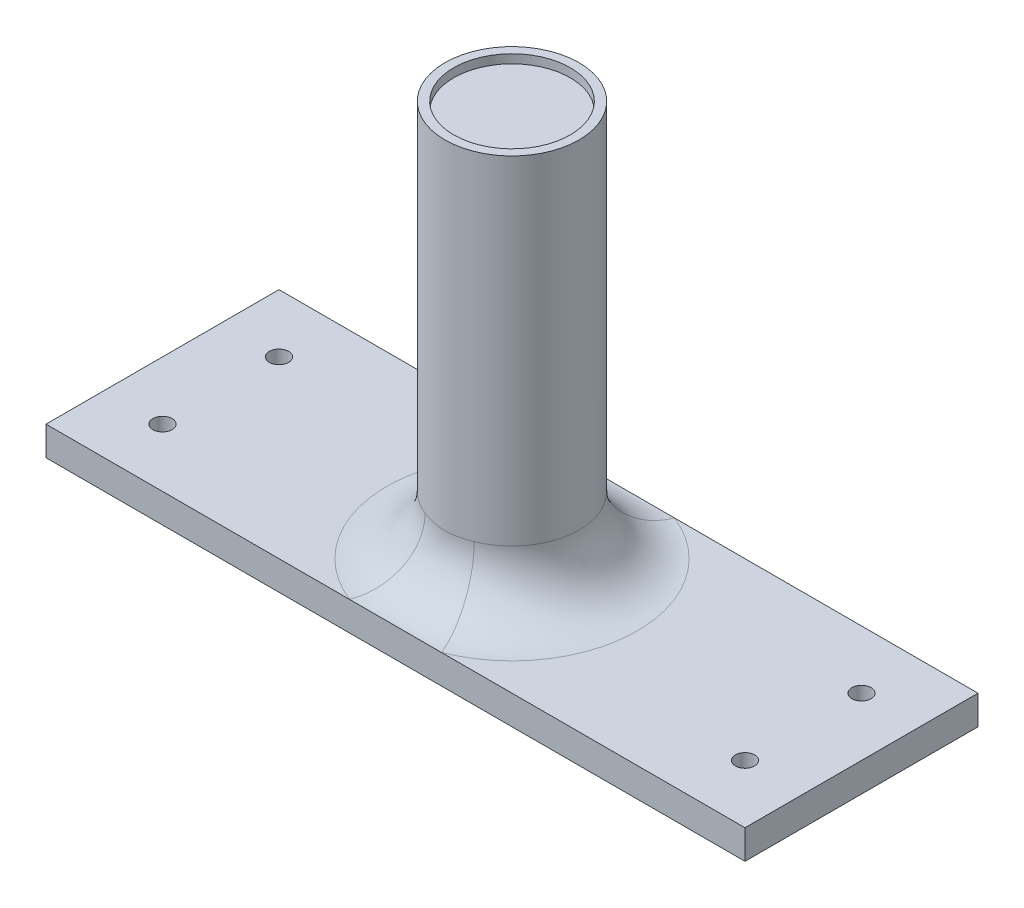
ISO-10303-21;
HEADER;
FILE_DESCRIPTION(('STEP AP214'),'2;1');
FILE_NAME('part.step','',(''),(''),'','','');
FILE_SCHEMA(('AUTOMOTIVE_DESIGN { 1 0 10303 214 1 1 1 1 }'));
ENDSEC;
DATA;
#1=APPLICATION_CONTEXT('core data for automotive mechanical design processes');
#2=APPLICATION_PROTOCOL_DEFINITION('international standard','automotive_design',2000,#1);
#3=PRODUCT_CONTEXT('',#1,'mechanical');
#4=PRODUCT('Part','Part','',(#3));
#5=PRODUCT_RELATED_PRODUCT_CATEGORY('part','',(#4));
#6=PRODUCT_DEFINITION_FORMATION('','',#4);
#7=PRODUCT_DEFINITION_CONTEXT('part definition',#1,'design');
#8=PRODUCT_DEFINITION('design','',#6,#7);
#9=PRODUCT_DEFINITION_SHAPE('','',#8);
#10=(LENGTH_UNIT() NAMED_UNIT(*) SI_UNIT(.MILLI.,.METRE.));
#11=(NAMED_UNIT(*) PLANE_ANGLE_UNIT() SI_UNIT($,.RADIAN.));
#12=(NAMED_UNIT(*) SI_UNIT($,.STERADIAN.) SOLID_ANGLE_UNIT());
#13=UNCERTAINTY_MEASURE_WITH_UNIT(LENGTH_MEASURE(1.E-05),#10,'distance_accuracy_value','');
#14=(GEOMETRIC_REPRESENTATION_CONTEXT(3) GLOBAL_UNCERTAINTY_ASSIGNED_CONTEXT((#13)) GLOBAL_UNIT_ASSIGNED_CONTEXT((#10,
#11,#12)) REPRESENTATION_CONTEXT('',''));
#15=CARTESIAN_POINT('',(0.,0.,0.));
#16=DIRECTION('',(0.,0.,1.));
#17=DIRECTION('',(1.,0.,0.));
#18=AXIS2_PLACEMENT_3D('',#15,#16,#17);
#19=CARTESIAN_POINT('',(0.,5.,0.));
#20=DIRECTION('',(0.,-1.,0.));
#21=DIRECTION('',(0.,0.,-1.));
#22=AXIS2_PLACEMENT_3D('',#19,#20,#21);
#23=PLANE('',#22);
#24=CARTESIAN_POINT('',(-50.,5.,10.));
#25=DIRECTION('',(0.,1.,0.));
#26=DIRECTION('',(0.,0.,1.));
#27=AXIS2_PLACEMENT_3D('',#24,#25,#26);
#28=CIRCLE('',#27,1.65);
#29=CARTESIAN_POINT('',(-50.,5.,11.65));
#30=VERTEX_POINT('',#29);
#31=EDGE_CURVE('E224',#30,#30,#28,.T.);
#32=ORIENTED_EDGE('',*,*,#31,.F.);
#33=EDGE_LOOP('',(#32));
#34=FACE_BOUND('',#33,.T.);
#35=CARTESIAN_POINT('',(-50.,5.,-10.));
#36=DIRECTION('',(0.,1.,0.));
#37=DIRECTION('',(0.,0.,1.));
#38=AXIS2_PLACEMENT_3D('',#35,#36,#37);
#39=CIRCLE('',#38,1.65);
#40=CARTESIAN_POINT('',(-50.,5.,-8.35));
#41=VERTEX_POINT('',#40);
#42=EDGE_CURVE('E228',#41,#41,#39,.T.);
#43=ORIENTED_EDGE('',*,*,#42,.F.);
#44=EDGE_LOOP('',(#43));
#45=FACE_BOUND('',#44,.T.);
#46=DIRECTION('',(1.,0.,0.));
#47=VECTOR('',#46,1.);
#48=CARTESIAN_POINT('',(-60.,5.,20.));
#49=LINE('',#48,#47);
#50=CARTESIAN_POINT('',(-60.,5.,20.));
#51=VERTEX_POINT('',#50);
#52=CARTESIAN_POINT('',(-7.88986691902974,5.,20.));
#53=VERTEX_POINT('',#52);
#54=EDGE_CURVE('E231',#51,#53,#49,.T.);
#55=ORIENTED_EDGE('',*,*,#54,.T.);
#56=CARTESIAN_POINT('',(0.,5.,0.));
#57=DIRECTION('',(0.,-1.,0.));
#58=DIRECTION('',(0.,0.,-1.));
#59=AXIS2_PLACEMENT_3D('',#56,#57,#58);
#60=CIRCLE('',#59,21.5);
#61=CARTESIAN_POINT('',(-7.88986691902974,5.,-20.));
#62=VERTEX_POINT('',#61);
#63=EDGE_CURVE('E11',#53,#62,#60,.T.);
#64=ORIENTED_EDGE('',*,*,#63,.T.);
#65=DIRECTION('',(-1.,0.,0.));
#66=VECTOR('',#65,1.);
#67=CARTESIAN_POINT('',(-60.,5.,-20.));
#68=LINE('',#67,#66);
#69=CARTESIAN_POINT('',(-60.,5.,-20.));
#70=VERTEX_POINT('',#69);
#71=EDGE_CURVE('E122',#62,#70,#68,.T.);
#72=ORIENTED_EDGE('',*,*,#71,.T.);
#73=DIRECTION('',(0.,0.,1.));
#74=VECTOR('',#73,1.);
#75=CARTESIAN_POINT('',(-60.,5.,20.));
#76=LINE('',#75,#74);
#77=EDGE_CURVE('E120',#70,#51,#76,.T.);
#78=ORIENTED_EDGE('',*,*,#77,.T.);
#79=EDGE_LOOP('',(#55,#64,#72,#78));
#80=FACE_BOUND('',#79,.T.);
#81=ADVANCED_FACE('F39',(#34,#45,#80),#23,.F.);
#82=CARTESIAN_POINT('',(60.,5.,-20.));
#83=VERTEX_POINT('',#82);
#84=CARTESIAN_POINT('',(7.88986691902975,5.,-20.));
#85=VERTEX_POINT('',#84);
#86=EDGE_CURVE('E110',#83,#85,#68,.T.);
#87=ORIENTED_EDGE('',*,*,#86,.T.);
#88=CARTESIAN_POINT('',(0.,5.,0.));
#89=DIRECTION('',(0.,-1.,0.));
#90=DIRECTION('',(0.,0.,-1.));
#91=AXIS2_PLACEMENT_3D('',#88,#89,#90);
#92=CIRCLE('',#91,21.5);
#93=CARTESIAN_POINT('',(7.88986691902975,5.,20.));
#94=VERTEX_POINT('',#93);
#95=EDGE_CURVE('E52',#85,#94,#92,.T.);
#96=ORIENTED_EDGE('',*,*,#95,.T.);
#97=CARTESIAN_POINT('',(60.,5.,20.));
#98=VERTEX_POINT('',#97);
#99=EDGE_CURVE('E127',#94,#98,#49,.T.);
#100=ORIENTED_EDGE('',*,*,#99,.T.);
#101=DIRECTION('',(0.,0.,-1.));
#102=VECTOR('',#101,1.);
#103=CARTESIAN_POINT('',(60.,5.,20.));
#104=LINE('',#103,#102);
#105=EDGE_CURVE('E124',#98,#83,#104,.T.);
#106=ORIENTED_EDGE('',*,*,#105,.T.);
#107=EDGE_LOOP('',(#87,#96,#100,#106));
#108=FACE_BOUND('',#107,.T.);
#109=CARTESIAN_POINT('',(50.,5.,-10.));
#110=DIRECTION('',(0.,1.,0.));
#111=DIRECTION('',(0.,0.,1.));
#112=AXIS2_PLACEMENT_3D('',#109,#110,#111);
#113=CIRCLE('',#112,1.65);
#114=CARTESIAN_POINT('',(50.,5.,-8.35));
#115=VERTEX_POINT('',#114);
#116=EDGE_CURVE('E247',#115,#115,#113,.T.);
#117=ORIENTED_EDGE('',*,*,#116,.F.);
#118=EDGE_LOOP('',(#117));
#119=FACE_BOUND('',#118,.T.);
#120=CARTESIAN_POINT('',(50.,5.,10.));
#121=DIRECTION('',(0.,1.,0.));
#122=DIRECTION('',(0.,0.,1.));
#123=AXIS2_PLACEMENT_3D('',#120,#121,#122);
#124=CIRCLE('',#123,1.65);
#125=CARTESIAN_POINT('',(50.,5.,11.65));
#126=VERTEX_POINT('',#125);
#127=EDGE_CURVE('E252',#126,#126,#124,.T.);
#128=ORIENTED_EDGE('',*,*,#127,.F.);
#129=EDGE_LOOP('',(#128));
#130=FACE_BOUND('',#129,.T.);
#131=ADVANCED_FACE('F125',(#108,#119,#130),#23,.F.);
#132=CARTESIAN_POINT('',(0.,0.,0.));
#133=DIRECTION('',(0.,-1.,0.));
#134=DIRECTION('',(0.,0.,-1.));
#135=AXIS2_PLACEMENT_3D('',#132,#133,#134);
#136=PLANE('',#135);
#137=CARTESIAN_POINT('',(50.,0.,10.));
#138=DIRECTION('',(0.,1.,0.));
#139=DIRECTION('',(0.,0.,1.));
#140=AXIS2_PLACEMENT_3D('',#137,#138,#139);
#141=CIRCLE('',#140,1.65);
#142=CARTESIAN_POINT('',(50.,0.,11.65));
#143=VERTEX_POINT('',#142);
#144=EDGE_CURVE('E255',#143,#143,#141,.T.);
#145=ORIENTED_EDGE('',*,*,#144,.T.);
#146=EDGE_LOOP('',(#145));
#147=FACE_BOUND('',#146,.T.);
#148=CARTESIAN_POINT('',(-50.,0.,-10.));
#149=DIRECTION('',(0.,1.,0.));
#150=DIRECTION('',(0.,0.,1.));
#151=AXIS2_PLACEMENT_3D('',#148,#149,#150);
#152=CIRCLE('',#151,1.65);
#153=CARTESIAN_POINT('',(-50.,0.,-8.35));
#154=VERTEX_POINT('',#153);
#155=EDGE_CURVE('E244',#154,#154,#152,.T.);
#156=ORIENTED_EDGE('',*,*,#155,.T.);
#157=EDGE_LOOP('',(#156));
#158=FACE_BOUND('',#157,.T.);
#159=DIRECTION('',(0.,0.,-1.));
#160=VECTOR('',#159,1.);
#161=CARTESIAN_POINT('',(60.,0.,20.));
#162=LINE('',#161,#160);
#163=CARTESIAN_POINT('',(60.,0.,20.));
#164=VERTEX_POINT('',#163);
#165=CARTESIAN_POINT('',(60.,0.,-20.));
#166=VERTEX_POINT('',#165);
#167=EDGE_CURVE('E135',#164,#166,#162,.T.);
#168=ORIENTED_EDGE('',*,*,#167,.F.);
#169=DIRECTION('',(1.,0.,0.));
#170=VECTOR('',#169,1.);
#171=CARTESIAN_POINT('',(-60.,0.,20.));
#172=LINE('',#171,#170);
#173=CARTESIAN_POINT('',(-60.,0.,20.));
#174=VERTEX_POINT('',#173);
#175=EDGE_CURVE('E131',#174,#164,#172,.T.);
#176=ORIENTED_EDGE('',*,*,#175,.F.);
#177=DIRECTION('',(0.,0.,1.));
#178=VECTOR('',#177,1.);
#179=CARTESIAN_POINT('',(-60.,0.,20.));
#180=LINE('',#179,#178);
#181=CARTESIAN_POINT('',(-60.,0.,-20.));
#182=VERTEX_POINT('',#181);
#183=EDGE_CURVE('E295',#182,#174,#180,.T.);
#184=ORIENTED_EDGE('',*,*,#183,.F.);
#185=DIRECTION('',(-1.,0.,0.));
#186=VECTOR('',#185,1.);
#187=CARTESIAN_POINT('',(-60.,0.,-20.));
#188=LINE('',#187,#186);
#189=EDGE_CURVE('E294',#166,#182,#188,.T.);
#190=ORIENTED_EDGE('',*,*,#189,.F.);
#191=EDGE_LOOP('',(#168,#176,#184,#190));
#192=FACE_BOUND('',#191,.T.);
#193=CARTESIAN_POINT('',(50.,0.,-10.));
#194=DIRECTION('',(0.,1.,0.));
#195=DIRECTION('',(0.,0.,1.));
#196=AXIS2_PLACEMENT_3D('',#193,#194,#195);
#197=CIRCLE('',#196,1.65);
#198=CARTESIAN_POINT('',(50.,0.,-8.35));
#199=VERTEX_POINT('',#198);
#200=EDGE_CURVE('E249',#199,#199,#197,.T.);
#201=ORIENTED_EDGE('',*,*,#200,.T.);
#202=EDGE_LOOP('',(#201));
#203=FACE_BOUND('',#202,.T.);
#204=CARTESIAN_POINT('',(-50.,0.,10.));
#205=DIRECTION('',(0.,1.,0.));
#206=DIRECTION('',(0.,0.,1.));
#207=AXIS2_PLACEMENT_3D('',#204,#205,#206);
#208=CIRCLE('',#207,1.65);
#209=CARTESIAN_POINT('',(-50.,0.,11.65));
#210=VERTEX_POINT('',#209);
#211=EDGE_CURVE('E260',#210,#210,#208,.T.);
#212=ORIENTED_EDGE('',*,*,#211,.T.);
#213=EDGE_LOOP('',(#212));
#214=FACE_BOUND('',#213,.T.);
#215=ADVANCED_FACE('F220',(#147,#158,#192,#203,#214),#136,.T.);
#216=CARTESIAN_POINT('',(60.,5.,20.));
#217=DIRECTION('',(-1.,0.,0.));
#218=DIRECTION('',(0.,0.,1.));
#219=AXIS2_PLACEMENT_3D('',#216,#217,#218);
#220=PLANE('',#219);
#221=ORIENTED_EDGE('',*,*,#167,.T.);
#222=DIRECTION('',(0.,-1.,0.));
#223=VECTOR('',#222,1.);
#224=CARTESIAN_POINT('',(60.,5.,-20.));
#225=LINE('',#224,#223);
#226=EDGE_CURVE('E114',#83,#166,#225,.T.);
#227=ORIENTED_EDGE('',*,*,#226,.F.);
#228=ORIENTED_EDGE('',*,*,#105,.F.);
#229=DIRECTION('',(0.,-1.,0.));
#230=VECTOR('',#229,1.);
#231=CARTESIAN_POINT('',(60.,5.,20.));
#232=LINE('',#231,#230);
#233=EDGE_CURVE('E237',#98,#164,#232,.T.);
#234=ORIENTED_EDGE('',*,*,#233,.T.);
#235=EDGE_LOOP('',(#221,#227,#228,#234));
#236=FACE_BOUND('',#235,.T.);
#237=ADVANCED_FACE('F133',(#236),#220,.F.);
#238=CARTESIAN_POINT('',(-60.,5.,-20.));
#239=DIRECTION('',(0.,0.,1.));
#240=DIRECTION('',(1.,0.,0.));
#241=AXIS2_PLACEMENT_3D('',#238,#239,#240);
#242=PLANE('',#241);
#243=ORIENTED_EDGE('',*,*,#189,.T.);
#244=DIRECTION('',(0.,-1.,0.));
#245=VECTOR('',#244,1.);
#246=CARTESIAN_POINT('',(-60.,5.,-20.));
#247=LINE('',#246,#245);
#248=EDGE_CURVE('E137',#70,#182,#247,.T.);
#249=ORIENTED_EDGE('',*,*,#248,.F.);
#250=ORIENTED_EDGE('',*,*,#71,.F.);
#251=EDGE_CURVE('E118',#85,#62,#68,.T.);
#252=ORIENTED_EDGE('',*,*,#251,.F.);
#253=ORIENTED_EDGE('',*,*,#86,.F.);
#254=ORIENTED_EDGE('',*,*,#226,.T.);
#255=EDGE_LOOP('',(#243,#249,#250,#252,#253,#254));
#256=FACE_BOUND('',#255,.T.);
#257=ADVANCED_FACE('F112',(#256),#242,.F.);
#258=CARTESIAN_POINT('',(-60.,5.,20.));
#259=DIRECTION('',(1.,0.,0.));
#260=DIRECTION('',(0.,0.,-1.));
#261=AXIS2_PLACEMENT_3D('',#258,#259,#260);
#262=PLANE('',#261);
#263=ORIENTED_EDGE('',*,*,#183,.T.);
#264=DIRECTION('',(0.,-1.,0.));
#265=VECTOR('',#264,1.);
#266=CARTESIAN_POINT('',(-60.,5.,20.));
#267=LINE('',#266,#265);
#268=EDGE_CURVE('E142',#51,#174,#267,.T.);
#269=ORIENTED_EDGE('',*,*,#268,.F.);
#270=ORIENTED_EDGE('',*,*,#77,.F.);
#271=ORIENTED_EDGE('',*,*,#248,.T.);
#272=EDGE_LOOP('',(#263,#269,#270,#271));
#273=FACE_BOUND('',#272,.T.);
#274=ADVANCED_FACE('F300',(#273),#262,.F.);
#275=CARTESIAN_POINT('',(-60.,5.,20.));
#276=DIRECTION('',(0.,0.,-1.));
#277=DIRECTION('',(-1.,0.,0.));
#278=AXIS2_PLACEMENT_3D('',#275,#276,#277);
#279=PLANE('',#278);
#280=ORIENTED_EDGE('',*,*,#175,.T.);
#281=ORIENTED_EDGE('',*,*,#233,.F.);
#282=ORIENTED_EDGE('',*,*,#99,.F.);
#283=EDGE_CURVE('E238',#53,#94,#49,.T.);
#284=ORIENTED_EDGE('',*,*,#283,.F.);
#285=ORIENTED_EDGE('',*,*,#54,.F.);
#286=ORIENTED_EDGE('',*,*,#268,.T.);
#287=EDGE_LOOP('',(#280,#281,#282,#284,#285,#286));
#288=FACE_BOUND('',#287,.T.);
#289=ADVANCED_FACE('F289',(#288),#279,.F.);
#290=CARTESIAN_POINT('',(-50.,5.,-10.));
#291=DIRECTION('',(0.,-1.,0.));
#292=DIRECTION('',(0.,0.,-1.));
#293=AXIS2_PLACEMENT_3D('',#290,#291,#292);
#294=CYLINDRICAL_SURFACE('',#293,1.65);
#295=ORIENTED_EDGE('',*,*,#42,.T.);
#296=EDGE_LOOP('',(#295));
#297=FACE_BOUND('',#296,.T.);
#298=ORIENTED_EDGE('',*,*,#155,.F.);
#299=EDGE_LOOP('',(#298));
#300=FACE_BOUND('',#299,.T.);
#301=ADVANCED_FACE('F307',(#297,#300),#294,.F.);
#302=CARTESIAN_POINT('',(50.,5.,-10.));
#303=DIRECTION('',(0.,-1.,0.));
#304=DIRECTION('',(0.,0.,-1.));
#305=AXIS2_PLACEMENT_3D('',#302,#303,#304);
#306=CYLINDRICAL_SURFACE('',#305,1.65);
#307=ORIENTED_EDGE('',*,*,#116,.T.);
#308=EDGE_LOOP('',(#307));
#309=FACE_BOUND('',#308,.T.);
#310=ORIENTED_EDGE('',*,*,#200,.F.);
#311=EDGE_LOOP('',(#310));
#312=FACE_BOUND('',#311,.T.);
#313=ADVANCED_FACE('F322',(#309,#312),#306,.F.);
#314=CARTESIAN_POINT('',(50.,5.,10.));
#315=DIRECTION('',(0.,-1.,0.));
#316=DIRECTION('',(0.,0.,-1.));
#317=AXIS2_PLACEMENT_3D('',#314,#315,#316);
#318=CYLINDRICAL_SURFACE('',#317,1.65);
#319=ORIENTED_EDGE('',*,*,#127,.T.);
#320=EDGE_LOOP('',(#319));
#321=FACE_BOUND('',#320,.T.);
#322=ORIENTED_EDGE('',*,*,#144,.F.);
#323=EDGE_LOOP('',(#322));
#324=FACE_BOUND('',#323,.T.);
#325=ADVANCED_FACE('F327',(#321,#324),#318,.F.);
#326=CARTESIAN_POINT('',(-50.,5.,10.));
#327=DIRECTION('',(0.,-1.,0.));
#328=DIRECTION('',(0.,0.,-1.));
#329=AXIS2_PLACEMENT_3D('',#326,#327,#328);
#330=CYLINDRICAL_SURFACE('',#329,1.65);
#331=ORIENTED_EDGE('',*,*,#31,.T.);
#332=EDGE_LOOP('',(#331));
#333=FACE_BOUND('',#332,.T.);
#334=ORIENTED_EDGE('',*,*,#211,.F.);
#335=EDGE_LOOP('',(#334));
#336=FACE_BOUND('',#335,.T.);
#337=ADVANCED_FACE('F332',(#333,#336),#330,.F.);
#338=CARTESIAN_POINT('',(0.,73.,0.));
#339=DIRECTION('',(0.,-1.,0.));
#340=DIRECTION('',(0.,0.,-1.));
#341=AXIS2_PLACEMENT_3D('',#338,#339,#340);
#342=CYLINDRICAL_SURFACE('',#341,11.5);
#343=CARTESIAN_POINT('',(0.,15.,0.));
#344=DIRECTION('',(0.,-1.,0.));
#345=DIRECTION('',(0.,0.,-1.));
#346=AXIS2_PLACEMENT_3D('',#343,#344,#345);
#347=CIRCLE('',#346,11.5);
#348=CARTESIAN_POINT('',(-4.22016137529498,15.,-10.6976744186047));
#349=VERTEX_POINT('',#348);
#350=CARTESIAN_POINT('',(-4.22016137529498,15.,10.6976744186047));
#351=VERTEX_POINT('',#350);
#352=EDGE_CURVE('E136',#349,#351,#347,.F.);
#353=ORIENTED_EDGE('',*,*,#352,.T.);
#354=CARTESIAN_POINT('',(-5.94353494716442,14.8721253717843,9.8450186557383));
#355=CARTESIAN_POINT('',(-5.12676086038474,3.43985259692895,10.3381132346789));
#356=CARTESIAN_POINT('',(-11.1118262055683,5.,20.));
#357=CARTESIAN_POINT('',(-5.81672784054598,14.8952245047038,9.92157627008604));
#358=CARTESIAN_POINT('',(-5.09520814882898,3.58350113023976,10.3429412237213));
#359=CARTESIAN_POINT('',(-10.8747520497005,5.,20.));
#360=CARTESIAN_POINT('',(-5.68831842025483,14.91443773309,9.99575189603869));
#361=CARTESIAN_POINT('',(-5.05365976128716,3.7231185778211,10.3555803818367));
#362=CARTESIAN_POINT('',(-10.6346822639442,5.,20.));
#363=CARTESIAN_POINT('',(-5.42857214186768,14.9462538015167,10.1391616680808));
#364=CARTESIAN_POINT('',(-4.95207874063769,3.99108176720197,10.3929374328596));
#365=CARTESIAN_POINT('',(-10.1490696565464,5.,20.));
#366=CARTESIAN_POINT('',(-5.2972358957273,14.9588580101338,10.2083968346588));
#367=CARTESIAN_POINT('',(-4.8922486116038,4.11963297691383,10.41751578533));
#368=CARTESIAN_POINT('',(-9.90352797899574,5.,20.));
#369=CARTESIAN_POINT('',(-4.89945459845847,14.9884890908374,10.4083299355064));
#370=CARTESIAN_POINT('',(-4.68836043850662,4.48485761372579,10.5035109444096));
#371=CARTESIAN_POINT('',(-9.15984990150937,5.,20.));
#372=CARTESIAN_POINT('',(-4.62896653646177,14.9973785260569,10.531418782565));
#373=CARTESIAN_POINT('',(-4.51838769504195,4.70683851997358,10.5777349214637));
#374=CARTESIAN_POINT('',(-8.65415482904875,5.,20.));
#375=CARTESIAN_POINT('',(-4.07957170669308,15.00160671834,10.7561682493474));
#376=CARTESIAN_POINT('',(-4.12274658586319,5.10109849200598,10.7374472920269));
#377=CARTESIAN_POINT('',(-7.62702536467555,5.,20.));
#378=CARTESIAN_POINT('',(-3.80067287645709,14.9969578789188,10.8578483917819));
#379=CARTESIAN_POINT('',(-3.8976118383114,5.2749551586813,10.8229452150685));
#380=CARTESIAN_POINT('',(-7.10560581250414,5.,20.));
#381=CARTESIAN_POINT('',(-3.23583568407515,14.9810221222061,11.0393557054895));
#382=CARTESIAN_POINT('',(-3.40439456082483,5.57679016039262,10.9888841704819));
#383=CARTESIAN_POINT('',(-6.04960584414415,5.,20.));
#384=CARTESIAN_POINT('',(-2.94989566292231,14.9697336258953,11.1191776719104));
#385=CARTESIAN_POINT('',(-3.13613651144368,5.70598382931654,11.0696837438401));
#386=CARTESIAN_POINT('',(-5.51502232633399,5.,20.));
#387=CARTESIAN_POINT('',(-2.36554718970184,14.9458225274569,11.258179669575));
#388=CARTESIAN_POINT('',(-2.56174951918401,5.92554005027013,11.2167647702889));
#389=CARTESIAN_POINT('',(-4.4225447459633,5.,20.));
#390=CARTESIAN_POINT('',(-2.06700542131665,14.9331737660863,11.3167981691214));
#391=CARTESIAN_POINT('',(-2.25404449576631,6.01583489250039,11.283145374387));
#392=CARTESIAN_POINT('',(-3.8644014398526,5.,20.));
#393=CARTESIAN_POINT('',(-1.46619943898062,14.9112678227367,11.4102003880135));
#394=CARTESIAN_POINT('',(-1.61826114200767,6.1571569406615,11.3910985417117));
#395=CARTESIAN_POINT('',(-2.7411554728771,5.,20.));
#396=CARTESIAN_POINT('',(-1.16393548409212,14.9020104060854,11.4449857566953));
#397=CARTESIAN_POINT('',(-1.28906571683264,6.20878910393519,11.4330909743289));
#398=CARTESIAN_POINT('',(-2.17605329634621,5.,20.));
#399=CARTESIAN_POINT('',(-0.557502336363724,14.8896317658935,11.4905031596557));
#400=CARTESIAN_POINT('',(-0.621617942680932,6.27576527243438,11.4881840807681));
#401=CARTESIAN_POINT('',(-1.04228697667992,5.,20.));
#402=CARTESIAN_POINT('',(-0.253332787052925,14.8865117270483,11.501230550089));
#403=CARTESIAN_POINT('',(-0.282010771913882,6.29138494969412,11.5015079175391));
#404=CARTESIAN_POINT('',(-0.47362216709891,5.,20.));
#405=CARTESIAN_POINT('',(0.35490294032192,14.8872718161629,11.4985451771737));
#406=CARTESIAN_POINT('',(0.395178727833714,6.28746841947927,11.4982165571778));
#407=CARTESIAN_POINT('',(0.663514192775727,5.,20.));
#408=CARTESIAN_POINT('',(0.658969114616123,14.8911521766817,11.4851316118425));
#409=CARTESIAN_POINT('',(0.734185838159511,6.26791458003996,11.4815864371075));
#410=CARTESIAN_POINT('',(1.23198573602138,5.,20.));
#411=CARTESIAN_POINT('',(1.28246819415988,14.9052407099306,11.4327898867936));
#412=CARTESIAN_POINT('',(1.41849567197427,6.19071772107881,11.4184291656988));
#413=CARTESIAN_POINT('',(2.39765792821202,5.,20.));
#414=CARTESIAN_POINT('',(1.60178014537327,14.9157996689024,11.3924399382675));
#415=CARTESIAN_POINT('',(1.76448480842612,6.13059371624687,11.3699535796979));
#416=CARTESIAN_POINT('',(2.99463244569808,5.,20.));
#417=CARTESIAN_POINT('',(2.23589524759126,14.9400165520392,11.2851315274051));
#418=CARTESIAN_POINT('',(2.42899242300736,5.96719083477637,11.2473589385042));
#419=CARTESIAN_POINT('',(4.18015198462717,5.,20.));
#420=CARTESIAN_POINT('',(2.55069790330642,14.9536748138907,11.2181701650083));
#421=CARTESIAN_POINT('',(2.74876636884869,5.86312632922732,11.1727148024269));
#422=CARTESIAN_POINT('',(4.76869608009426,5.,20.));
#423=CARTESIAN_POINT('',(3.17326048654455,14.9783853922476,11.0581917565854));
#424=CARTESIAN_POINT('',(3.34705106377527,5.60751441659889,11.0080207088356));
#425=CARTESIAN_POINT('',(5.93261743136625,5.,20.));
#426=CARTESIAN_POINT('',(3.48102797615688,14.9894406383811,10.9652042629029));
#427=CARTESIAN_POINT('',(3.626332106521,5.45479186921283,10.9174109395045));
#428=CARTESIAN_POINT('',(6.50800882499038,5.,20.));
#429=CARTESIAN_POINT('',(4.0877555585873,15.001405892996,10.7537624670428));
#430=CARTESIAN_POINT('',(4.12987740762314,5.09711953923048,10.7361873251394));
#431=CARTESIAN_POINT('',(7.6423256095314,5.,20.));
#432=CARTESIAN_POINT('',(4.38671679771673,15.0023172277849,10.6353114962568));
#433=CARTESIAN_POINT('',(4.3541183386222,4.89048391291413,10.6452126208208));
#434=CARTESIAN_POINT('',(8.2012531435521,5.,20.));
#435=CARTESIAN_POINT('',(4.90244382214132,14.9867882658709,10.4055423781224));
#436=CARTESIAN_POINT('',(4.6860802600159,4.48050826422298,10.5055120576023));
#437=CARTESIAN_POINT('',(9.16543845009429,5.,20.));
#438=CARTESIAN_POINT('',(5.12158079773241,14.9744968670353,10.2994444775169));
#439=CARTESIAN_POINT('',(4.80907521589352,4.28661203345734,10.4517246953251));
#440=CARTESIAN_POINT('',(9.57512931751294,5.,20.));
#441=CARTESIAN_POINT('',(5.5522627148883,14.9340061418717,10.0737993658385));
#442=CARTESIAN_POINT('',(5.00854619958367,3.86864175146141,10.370330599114));
#443=CARTESIAN_POINT('',(10.3803172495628,5.,20.));
#444=CARTESIAN_POINT('',(5.76381184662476,14.9058157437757,9.95425973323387));
#445=CARTESIAN_POINT('',(5.08428739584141,3.64365712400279,10.3431618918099));
#446=CARTESIAN_POINT('',(10.7758221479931,5.,20.));
#447=CARTESIAN_POINT('',(6.17884886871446,14.8281680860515,9.70210959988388));
#448=CARTESIAN_POINT('',(5.18394196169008,3.16740186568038,10.3310617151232));
#449=CARTESIAN_POINT('',(11.5517609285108,5.,20.));
#450=CARTESIAN_POINT('',(6.38230840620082,14.7786421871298,9.56945798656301));
#451=CARTESIAN_POINT('',(5.20659542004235,2.91525245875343,10.3471884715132));
#452=CARTESIAN_POINT('',(11.9321418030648,5.,20.));
#453=CARTESIAN_POINT('',(6.67983657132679,14.6840490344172,9.36186215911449));
#454=CARTESIAN_POINT('',(5.19902043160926,2.52796203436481,10.416810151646));
#455=CARTESIAN_POINT('',(12.4883901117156,5.,20.));
#456=CARTESIAN_POINT('',(6.77782014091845,14.64909347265,9.29115990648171));
#457=CARTESIAN_POINT('',(5.18928028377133,2.39604991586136,10.4481029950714));
#458=CARTESIAN_POINT('',(12.6715767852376,5.,20.));
#459=CARTESIAN_POINT('',(6.97099329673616,14.5716350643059,9.14711900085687));
#460=CARTESIAN_POINT('',(5.15582162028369,2.13060295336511,10.5285337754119));
#461=CARTESIAN_POINT('',(13.0327265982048,5.,20.));
#462=CARTESIAN_POINT('',(7.06618214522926,14.5291302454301,9.07377966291));
#463=CARTESIAN_POINT('',(5.13193519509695,1.99705254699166,10.577885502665));
#464=CARTESIAN_POINT('',(13.2106883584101,5.,20.));
#465=CARTESIAN_POINT('',(7.15986217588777,14.4824727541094,8.9992429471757));
#466=CARTESIAN_POINT('',(5.10129600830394,1.86469631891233,10.6370529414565));
#467=CARTESIAN_POINT('',(13.3858292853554,5.,20.));
#468=(BOUNDED_SURFACE() B_SPLINE_SURFACE(3,2,((#354,#355,#356),(#357,#358,#359),(#360,#361,
#362),(#363,#364,#365),(#366,#367,#368),(#369,#370,#371),(#372,#373,#374),(#375,#376,#377),
(#378,#379,#380),(#381,#382,#383),(#384,#385,#386),(#387,#388,#389),(#390,#391,#392),(#393,#394,
#395),(#396,#397,#398),(#399,#400,#401),(#402,#403,#404),(#405,#406,#407),(#408,#409,#410),
(#411,#412,#413),(#414,#415,#416),(#417,#418,#419),(#420,#421,#422),(#423,#424,#425),(#426,#427,
#428),(#429,#430,#431),(#432,#433,#434),(#435,#436,#437),(#438,#439,#440),(#441,#442,#443),
(#444,#445,#446),(#447,#448,#449),(#450,#451,#452),(#453,#454,#455),(#456,#457,#458),(#459,#460,
#461),(#462,#463,#464),(#465,#466,#467)),.UNSPECIFIED.,.F.,.F.,
.F.) B_SPLINE_SURFACE_WITH_KNOTS((4,2,2,2,2,2,2,2,2,2,2,2,2,2,2,2,2,2,4),(3,3),(0.,
0.833491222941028,1.66680978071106,3.33167627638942,4.99501793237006,6.65875531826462,
8.36378842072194,10.0687035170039,11.7739476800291,13.4792484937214,15.2825363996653,
17.0860208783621,18.88746577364,20.6886751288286,22.0536536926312,23.4178665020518,
24.786501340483,25.4720486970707,26.157775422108),(0.,1.),
.UNSPECIFIED.) GEOMETRIC_REPRESENTATION_ITEM() RATIONAL_B_SPLINE_SURFACE(((1.,0.657088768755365,
1.),(1.,0.661347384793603,1.),(1.,0.665539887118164,1.),(1.,0.673753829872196,1.),(1.,
0.677775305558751,1.),(1.,0.689519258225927,1.),(1.,0.696930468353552,1.),(1.,0.710675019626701,
1.),(1.,0.717009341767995,1.),(1.,0.728440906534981,1.),(1.,0.73353785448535,1.),(1.,
0.742477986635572,1.),(1.,0.746286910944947,1.),(1.,0.752381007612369,1.),(1.,0.75466628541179,
1.),(1.,0.757660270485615,1.),(1.,0.758368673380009,1.),(1.,0.758191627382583,1.),(1.,
0.75730612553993,1.),(1.,0.753865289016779,1.),(1.,0.751216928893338,1.),(1.,0.744229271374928,
1.),(1.,0.739889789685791,1.),(1.,0.729643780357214,1.),(1.,0.723739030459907,1.),(1.,
0.71053174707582,1.),(1.,0.703229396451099,1.),(1.,0.689381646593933,1.),(1.,0.683081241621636,
1.),(1.,0.669965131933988,1.),(1.,0.663149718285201,1.),(1.,0.649157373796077,1.),(1.,
0.641979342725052,1.),(1.,0.631126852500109,1.),(1.,0.627491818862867,1.),(1.,0.620228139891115,
1.),(1.,0.616599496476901,1.),(1.,0.612991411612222,1.))) REPRESENTATION_ITEM('') SURFACE());
#469=CARTESIAN_POINT('',(-5.94353494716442,14.8721253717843,9.8450186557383));
#470=CARTESIAN_POINT('',(-5.81672784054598,14.8952245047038,9.92157627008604));
#471=CARTESIAN_POINT('',(-5.68831842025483,14.91443773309,9.99575189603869));
#472=CARTESIAN_POINT('',(-5.42857214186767,14.9462538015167,10.1391616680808));
#473=CARTESIAN_POINT('',(-5.2972358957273,14.9588580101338,10.2083968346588));
#474=CARTESIAN_POINT('',(-4.89945459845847,14.9884890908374,10.4083299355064));
#475=CARTESIAN_POINT('',(-4.62896653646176,14.9973785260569,10.531418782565));
#476=CARTESIAN_POINT('',(-4.07957170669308,15.00160671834,10.7561682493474));
#477=CARTESIAN_POINT('',(-3.80067287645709,14.9969578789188,10.8578483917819));
#478=CARTESIAN_POINT('',(-3.23583568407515,14.9810221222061,11.0393557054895));
#479=CARTESIAN_POINT('',(-2.94989566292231,14.9697336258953,11.1191776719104));
#480=CARTESIAN_POINT('',(-2.36554718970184,14.9458225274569,11.258179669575));
#481=CARTESIAN_POINT('',(-2.06700542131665,14.9331737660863,11.3167981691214));
#482=CARTESIAN_POINT('',(-1.46619943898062,14.9112678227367,11.4102003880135));
#483=CARTESIAN_POINT('',(-1.16393548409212,14.9020104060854,11.4449857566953));
#484=CARTESIAN_POINT('',(-0.557502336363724,14.8896317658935,11.4905031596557));
#485=CARTESIAN_POINT('',(-0.253332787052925,14.8865117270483,11.501230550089));
#486=CARTESIAN_POINT('',(0.35490294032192,14.8872718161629,11.4985451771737));
#487=CARTESIAN_POINT('',(0.658969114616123,14.8911521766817,11.4851316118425));
#488=CARTESIAN_POINT('',(1.28246819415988,14.9052407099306,11.4327898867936));
#489=CARTESIAN_POINT('',(1.60178014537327,14.9157996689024,11.3924399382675));
#490=CARTESIAN_POINT('',(2.23589524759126,14.9400165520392,11.2851315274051));
#491=CARTESIAN_POINT('',(2.55069790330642,14.9536748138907,11.2181701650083));
#492=CARTESIAN_POINT('',(3.17326048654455,14.9783853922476,11.0581917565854));
#493=CARTESIAN_POINT('',(3.48102797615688,14.9894406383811,10.9652042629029));
#494=CARTESIAN_POINT('',(4.0877555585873,15.001405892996,10.7537624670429));
#495=CARTESIAN_POINT('',(4.38671679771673,15.0023172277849,10.6353114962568));
#496=CARTESIAN_POINT('',(4.90244382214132,14.9867882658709,10.4055423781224));
#497=CARTESIAN_POINT('',(5.12158079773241,14.9744968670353,10.2994444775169));
#498=CARTESIAN_POINT('',(5.5522627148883,14.9340061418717,10.0737993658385));
#499=CARTESIAN_POINT('',(5.76381184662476,14.9058157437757,9.95425973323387));
#500=CARTESIAN_POINT('',(6.17884886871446,14.8281680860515,9.70210959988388));
#501=CARTESIAN_POINT('',(6.38230840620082,14.7786421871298,9.56945798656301));
#502=CARTESIAN_POINT('',(6.67983657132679,14.6840490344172,9.36186215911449));
#503=CARTESIAN_POINT('',(6.77782014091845,14.64909347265,9.2911599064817));
#504=CARTESIAN_POINT('',(6.97099329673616,14.5716350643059,9.14711900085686));
#505=CARTESIAN_POINT('',(7.06618214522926,14.5291302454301,9.07377966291));
#506=CARTESIAN_POINT('',(7.15986217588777,14.4824727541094,8.9992429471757));
#507=B_SPLINE_CURVE_WITH_KNOTS('',3,(#469,#470,#471,#472,#473,#474,#475,#476,#477,#478,#479,
#480,#481,#482,#483,#484,#485,#486,#487,#488,#489,#490,#491,#492,#493,#494,#495,#496,#497,#498,
#499,#500,#501,#502,#503,#504,#505,#506),.UNSPECIFIED.,.F.,.F.,(4,2,2,2,2,2,2,2,2,2,2,2,2,2,2,2,
2,2,4),(0.,0.833491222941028,1.66680978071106,3.33167627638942,4.99501793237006,
6.65875531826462,8.36378842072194,10.0687035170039,11.7739476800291,13.4792484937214,
15.2825363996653,17.0860208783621,18.88746577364,20.6886751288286,22.0536536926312,
23.4178665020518,24.786501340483,25.4720486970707,26.157775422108),.UNSPECIFIED.);
#508=CARTESIAN_POINT('',(4.22016137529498,15.,10.6976744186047));
#509=VERTEX_POINT('',#508);
#510=EDGE_CURVE('E278',#351,#509,#507,.T.);
#511=ORIENTED_EDGE('',*,*,#510,.T.);
#512=CARTESIAN_POINT('',(0.,15.,0.));
#513=DIRECTION('',(0.,-1.,0.));
#514=DIRECTION('',(0.,0.,-1.));
#515=AXIS2_PLACEMENT_3D('',#512,#513,#514);
#516=CIRCLE('',#515,11.5);
#517=CARTESIAN_POINT('',(4.22016137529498,15.,-10.6976744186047));
#518=VERTEX_POINT('',#517);
#519=EDGE_CURVE('E153',#509,#518,#516,.F.);
#520=ORIENTED_EDGE('',*,*,#519,.T.);
#521=CARTESIAN_POINT('',(5.94353494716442,14.8721253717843,-9.8450186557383));
#522=CARTESIAN_POINT('',(5.12676086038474,3.43985259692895,-10.3381132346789));
#523=CARTESIAN_POINT('',(11.1118262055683,5.,-20.));
#524=CARTESIAN_POINT('',(5.81672784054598,14.8952245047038,-9.92157627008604));
#525=CARTESIAN_POINT('',(5.09520814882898,3.58350113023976,-10.3429412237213));
#526=CARTESIAN_POINT('',(10.8747520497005,5.,-20.));
#527=CARTESIAN_POINT('',(5.68831842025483,14.91443773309,-9.99575189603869));
#528=CARTESIAN_POINT('',(5.05365976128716,3.7231185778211,-10.3555803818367));
#529=CARTESIAN_POINT('',(10.6346822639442,5.,-20.));
#530=CARTESIAN_POINT('',(5.42857214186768,14.9462538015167,-10.1391616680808));
#531=CARTESIAN_POINT('',(4.95207874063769,3.99108176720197,-10.3929374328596));
#532=CARTESIAN_POINT('',(10.1490696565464,5.,-20.));
#533=CARTESIAN_POINT('',(5.2972358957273,14.9588580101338,-10.2083968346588));
#534=CARTESIAN_POINT('',(4.8922486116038,4.11963297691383,-10.41751578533));
#535=CARTESIAN_POINT('',(9.90352797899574,5.,-20.));
#536=CARTESIAN_POINT('',(4.89945459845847,14.9884890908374,-10.4083299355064));
#537=CARTESIAN_POINT('',(4.68836043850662,4.48485761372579,-10.5035109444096));
#538=CARTESIAN_POINT('',(9.15984990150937,5.,-20.));
#539=CARTESIAN_POINT('',(4.62896653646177,14.9973785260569,-10.531418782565));
#540=CARTESIAN_POINT('',(4.51838769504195,4.70683851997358,-10.5777349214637));
#541=CARTESIAN_POINT('',(8.65415482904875,5.,-20.));
#542=CARTESIAN_POINT('',(4.07957170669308,15.00160671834,-10.7561682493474));
#543=CARTESIAN_POINT('',(4.12274658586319,5.10109849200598,-10.7374472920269));
#544=CARTESIAN_POINT('',(7.62702536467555,5.,-20.));
#545=CARTESIAN_POINT('',(3.80067287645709,14.9969578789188,-10.8578483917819));
#546=CARTESIAN_POINT('',(3.8976118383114,5.2749551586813,-10.8229452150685));
#547=CARTESIAN_POINT('',(7.10560581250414,5.,-20.));
#548=CARTESIAN_POINT('',(3.23583568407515,14.9810221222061,-11.0393557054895));
#549=CARTESIAN_POINT('',(3.40439456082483,5.57679016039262,-10.9888841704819));
#550=CARTESIAN_POINT('',(6.04960584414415,5.,-20.));
#551=CARTESIAN_POINT('',(2.94989566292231,14.9697336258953,-11.1191776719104));
#552=CARTESIAN_POINT('',(3.13613651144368,5.70598382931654,-11.0696837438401));
#553=CARTESIAN_POINT('',(5.51502232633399,5.,-20.));
#554=CARTESIAN_POINT('',(2.36554718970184,14.9458225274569,-11.258179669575));
#555=CARTESIAN_POINT('',(2.56174951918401,5.92554005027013,-11.2167647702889));
#556=CARTESIAN_POINT('',(4.4225447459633,5.,-20.));
#557=CARTESIAN_POINT('',(2.06700542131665,14.9331737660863,-11.3167981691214));
#558=CARTESIAN_POINT('',(2.25404449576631,6.01583489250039,-11.283145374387));
#559=CARTESIAN_POINT('',(3.8644014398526,5.,-20.));
#560=CARTESIAN_POINT('',(1.46619943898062,14.9112678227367,-11.4102003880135));
#561=CARTESIAN_POINT('',(1.61826114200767,6.1571569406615,-11.3910985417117));
#562=CARTESIAN_POINT('',(2.7411554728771,5.,-20.));
#563=CARTESIAN_POINT('',(1.16393548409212,14.9020104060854,-11.4449857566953));
#564=CARTESIAN_POINT('',(1.28906571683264,6.20878910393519,-11.4330909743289));
#565=CARTESIAN_POINT('',(2.17605329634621,5.,-20.));
#566=CARTESIAN_POINT('',(0.557502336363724,14.8896317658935,-11.4905031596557));
#567=CARTESIAN_POINT('',(0.621617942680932,6.27576527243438,-11.4881840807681));
#568=CARTESIAN_POINT('',(1.04228697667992,5.,-20.));
#569=CARTESIAN_POINT('',(0.253332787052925,14.8865117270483,-11.501230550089));
#570=CARTESIAN_POINT('',(0.282010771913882,6.29138494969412,-11.5015079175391));
#571=CARTESIAN_POINT('',(0.47362216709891,5.,-20.));
#572=CARTESIAN_POINT('',(-0.35490294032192,14.8872718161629,-11.4985451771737));
#573=CARTESIAN_POINT('',(-0.395178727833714,6.28746841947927,-11.4982165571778));
#574=CARTESIAN_POINT('',(-0.663514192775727,5.,-20.));
#575=CARTESIAN_POINT('',(-0.658969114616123,14.8911521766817,-11.4851316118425));
#576=CARTESIAN_POINT('',(-0.734185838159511,6.26791458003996,-11.4815864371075));
#577=CARTESIAN_POINT('',(-1.23198573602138,5.,-20.));
#578=CARTESIAN_POINT('',(-1.28246819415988,14.9052407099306,-11.4327898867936));
#579=CARTESIAN_POINT('',(-1.41849567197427,6.19071772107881,-11.4184291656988));
#580=CARTESIAN_POINT('',(-2.39765792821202,5.,-20.));
#581=CARTESIAN_POINT('',(-1.60178014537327,14.9157996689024,-11.3924399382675));
#582=CARTESIAN_POINT('',(-1.76448480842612,6.13059371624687,-11.3699535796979));
#583=CARTESIAN_POINT('',(-2.99463244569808,5.,-20.));
#584=CARTESIAN_POINT('',(-2.23589524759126,14.9400165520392,-11.2851315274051));
#585=CARTESIAN_POINT('',(-2.42899242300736,5.96719083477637,-11.2473589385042));
#586=CARTESIAN_POINT('',(-4.18015198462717,5.,-20.));
#587=CARTESIAN_POINT('',(-2.55069790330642,14.9536748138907,-11.2181701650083));
#588=CARTESIAN_POINT('',(-2.74876636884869,5.86312632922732,-11.1727148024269));
#589=CARTESIAN_POINT('',(-4.76869608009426,5.,-20.));
#590=CARTESIAN_POINT('',(-3.17326048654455,14.9783853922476,-11.0581917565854));
#591=CARTESIAN_POINT('',(-3.34705106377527,5.60751441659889,-11.0080207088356));
#592=CARTESIAN_POINT('',(-5.93261743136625,5.,-20.));
#593=CARTESIAN_POINT('',(-3.48102797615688,14.9894406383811,-10.9652042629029));
#594=CARTESIAN_POINT('',(-3.626332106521,5.45479186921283,-10.9174109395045));
#595=CARTESIAN_POINT('',(-6.50800882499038,5.,-20.));
#596=CARTESIAN_POINT('',(-4.0877555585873,15.001405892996,-10.7537624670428));
#597=CARTESIAN_POINT('',(-4.12987740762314,5.09711953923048,-10.7361873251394));
#598=CARTESIAN_POINT('',(-7.6423256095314,5.,-20.));
#599=CARTESIAN_POINT('',(-4.38671679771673,15.0023172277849,-10.6353114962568));
#600=CARTESIAN_POINT('',(-4.3541183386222,4.89048391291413,-10.6452126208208));
#601=CARTESIAN_POINT('',(-8.2012531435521,5.,-20.));
#602=CARTESIAN_POINT('',(-4.90244382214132,14.9867882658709,-10.4055423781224));
#603=CARTESIAN_POINT('',(-4.6860802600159,4.48050826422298,-10.5055120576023));
#604=CARTESIAN_POINT('',(-9.16543845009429,5.,-20.));
#605=CARTESIAN_POINT('',(-5.12158079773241,14.9744968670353,-10.2994444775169));
#606=CARTESIAN_POINT('',(-4.80907521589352,4.28661203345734,-10.4517246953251));
#607=CARTESIAN_POINT('',(-9.57512931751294,5.,-20.));
#608=CARTESIAN_POINT('',(-5.5522627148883,14.9340061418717,-10.0737993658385));
#609=CARTESIAN_POINT('',(-5.00854619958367,3.86864175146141,-10.370330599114));
#610=CARTESIAN_POINT('',(-10.3803172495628,5.,-20.));
#611=CARTESIAN_POINT('',(-5.76381184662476,14.9058157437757,-9.95425973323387));
#612=CARTESIAN_POINT('',(-5.08428739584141,3.64365712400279,-10.3431618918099));
#613=CARTESIAN_POINT('',(-10.7758221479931,5.,-20.));
#614=CARTESIAN_POINT('',(-6.17884886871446,14.8281680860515,-9.70210959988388));
#615=CARTESIAN_POINT('',(-5.18394196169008,3.16740186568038,-10.3310617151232));
#616=CARTESIAN_POINT('',(-11.5517609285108,5.,-20.));
#617=CARTESIAN_POINT('',(-6.38230840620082,14.7786421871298,-9.56945798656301));
#618=CARTESIAN_POINT('',(-5.20659542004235,2.91525245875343,-10.3471884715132));
#619=CARTESIAN_POINT('',(-11.9321418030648,5.,-20.));
#620=CARTESIAN_POINT('',(-6.67983657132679,14.6840490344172,-9.36186215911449));
#621=CARTESIAN_POINT('',(-5.19902043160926,2.52796203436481,-10.416810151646));
#622=CARTESIAN_POINT('',(-12.4883901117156,5.,-20.));
#623=CARTESIAN_POINT('',(-6.77782014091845,14.64909347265,-9.29115990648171));
#624=CARTESIAN_POINT('',(-5.18928028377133,2.39604991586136,-10.4481029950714));
#625=CARTESIAN_POINT('',(-12.6715767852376,5.,-20.));
#626=CARTESIAN_POINT('',(-6.97099329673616,14.5716350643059,-9.14711900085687));
#627=CARTESIAN_POINT('',(-5.15582162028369,2.13060295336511,-10.5285337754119));
#628=CARTESIAN_POINT('',(-13.0327265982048,5.,-20.));
#629=CARTESIAN_POINT('',(-7.06618214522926,14.5291302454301,-9.07377966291));
#630=CARTESIAN_POINT('',(-5.13193519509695,1.99705254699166,-10.577885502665));
#631=CARTESIAN_POINT('',(-13.2106883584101,5.,-20.));
#632=CARTESIAN_POINT('',(-7.15986217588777,14.4824727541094,-8.9992429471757));
#633=CARTESIAN_POINT('',(-5.10129600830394,1.86469631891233,-10.6370529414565));
#634=CARTESIAN_POINT('',(-13.3858292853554,5.,-20.));
#635=(BOUNDED_SURFACE() B_SPLINE_SURFACE(3,2,((#521,#522,#523),(#524,#525,#526),(#527,#528,
#529),(#530,#531,#532),(#533,#534,#535),(#536,#537,#538),(#539,#540,#541),(#542,#543,#544),
(#545,#546,#547),(#548,#549,#550),(#551,#552,#553),(#554,#555,#556),(#557,#558,#559),(#560,#561,
#562),(#563,#564,#565),(#566,#567,#568),(#569,#570,#571),(#572,#573,#574),(#575,#576,#577),
(#578,#579,#580),(#581,#582,#583),(#584,#585,#586),(#587,#588,#589),(#590,#591,#592),(#593,#594,
#595),(#596,#597,#598),(#599,#600,#601),(#602,#603,#604),(#605,#606,#607),(#608,#609,#610),
(#611,#612,#613),(#614,#615,#616),(#617,#618,#619),(#620,#621,#622),(#623,#624,#625),(#626,#627,
#628),(#629,#630,#631),(#632,#633,#634)),.UNSPECIFIED.,.F.,.F.,
.F.) B_SPLINE_SURFACE_WITH_KNOTS((4,2,2,2,2,2,2,2,2,2,2,2,2,2,2,2,2,2,4),(3,3),(0.,
0.833491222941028,1.66680978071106,3.33167627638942,4.99501793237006,6.65875531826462,
8.36378842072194,10.0687035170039,11.7739476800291,13.4792484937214,15.2825363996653,
17.0860208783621,18.88746577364,20.6886751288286,22.0536536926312,23.4178665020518,
24.786501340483,25.4720486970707,26.157775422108),(0.,1.),
.UNSPECIFIED.) GEOMETRIC_REPRESENTATION_ITEM() RATIONAL_B_SPLINE_SURFACE(((1.,0.657088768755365,
1.),(1.,0.661347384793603,1.),(1.,0.665539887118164,1.),(1.,0.673753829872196,1.),(1.,
0.677775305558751,1.),(1.,0.689519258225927,1.),(1.,0.696930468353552,1.),(1.,0.710675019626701,
1.),(1.,0.717009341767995,1.),(1.,0.728440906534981,1.),(1.,0.73353785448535,1.),(1.,
0.742477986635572,1.),(1.,0.746286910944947,1.),(1.,0.752381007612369,1.),(1.,0.75466628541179,
1.),(1.,0.757660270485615,1.),(1.,0.758368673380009,1.),(1.,0.758191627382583,1.),(1.,
0.75730612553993,1.),(1.,0.753865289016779,1.),(1.,0.751216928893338,1.),(1.,0.744229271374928,
1.),(1.,0.739889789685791,1.),(1.,0.729643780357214,1.),(1.,0.723739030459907,1.),(1.,
0.71053174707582,1.),(1.,0.703229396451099,1.),(1.,0.689381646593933,1.),(1.,0.683081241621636,
1.),(1.,0.669965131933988,1.),(1.,0.663149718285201,1.),(1.,0.649157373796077,1.),(1.,
0.641979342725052,1.),(1.,0.631126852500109,1.),(1.,0.627491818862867,1.),(1.,0.620228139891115,
1.),(1.,0.616599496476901,1.),(1.,0.612991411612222,1.))) REPRESENTATION_ITEM('') SURFACE());
#636=CARTESIAN_POINT('',(5.94353494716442,14.8721253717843,-9.8450186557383));
#637=CARTESIAN_POINT('',(5.81672784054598,14.8952245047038,-9.92157627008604));
#638=CARTESIAN_POINT('',(5.68831842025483,14.91443773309,-9.99575189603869));
#639=CARTESIAN_POINT('',(5.42857214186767,14.9462538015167,-10.1391616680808));
#640=CARTESIAN_POINT('',(5.2972358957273,14.9588580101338,-10.2083968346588));
#641=CARTESIAN_POINT('',(4.89945459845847,14.9884890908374,-10.4083299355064));
#642=CARTESIAN_POINT('',(4.62896653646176,14.9973785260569,-10.531418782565));
#643=CARTESIAN_POINT('',(4.07957170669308,15.00160671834,-10.7561682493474));
#644=CARTESIAN_POINT('',(3.80067287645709,14.9969578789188,-10.8578483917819));
#645=CARTESIAN_POINT('',(3.23583568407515,14.9810221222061,-11.0393557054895));
#646=CARTESIAN_POINT('',(2.94989566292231,14.9697336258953,-11.1191776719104));
#647=CARTESIAN_POINT('',(2.36554718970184,14.9458225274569,-11.258179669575));
#648=CARTESIAN_POINT('',(2.06700542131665,14.9331737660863,-11.3167981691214));
#649=CARTESIAN_POINT('',(1.46619943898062,14.9112678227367,-11.4102003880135));
#650=CARTESIAN_POINT('',(1.16393548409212,14.9020104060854,-11.4449857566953));
#651=CARTESIAN_POINT('',(0.557502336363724,14.8896317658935,-11.4905031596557));
#652=CARTESIAN_POINT('',(0.253332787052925,14.8865117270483,-11.501230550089));
#653=CARTESIAN_POINT('',(-0.35490294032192,14.8872718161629,-11.4985451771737));
#654=CARTESIAN_POINT('',(-0.658969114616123,14.8911521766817,-11.4851316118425));
#655=CARTESIAN_POINT('',(-1.28246819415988,14.9052407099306,-11.4327898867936));
#656=CARTESIAN_POINT('',(-1.60178014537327,14.9157996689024,-11.3924399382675));
#657=CARTESIAN_POINT('',(-2.23589524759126,14.9400165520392,-11.2851315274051));
#658=CARTESIAN_POINT('',(-2.55069790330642,14.9536748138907,-11.2181701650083));
#659=CARTESIAN_POINT('',(-3.17326048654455,14.9783853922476,-11.0581917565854));
#660=CARTESIAN_POINT('',(-3.48102797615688,14.9894406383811,-10.9652042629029));
#661=CARTESIAN_POINT('',(-4.0877555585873,15.001405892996,-10.7537624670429));
#662=CARTESIAN_POINT('',(-4.38671679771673,15.0023172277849,-10.6353114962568));
#663=CARTESIAN_POINT('',(-4.90244382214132,14.9867882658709,-10.4055423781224));
#664=CARTESIAN_POINT('',(-5.12158079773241,14.9744968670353,-10.2994444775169));
#665=CARTESIAN_POINT('',(-5.5522627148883,14.9340061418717,-10.0737993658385));
#666=CARTESIAN_POINT('',(-5.76381184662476,14.9058157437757,-9.95425973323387));
#667=CARTESIAN_POINT('',(-6.17884886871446,14.8281680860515,-9.70210959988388));
#668=CARTESIAN_POINT('',(-6.38230840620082,14.7786421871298,-9.56945798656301));
#669=CARTESIAN_POINT('',(-6.67983657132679,14.6840490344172,-9.36186215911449));
#670=CARTESIAN_POINT('',(-6.77782014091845,14.64909347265,-9.2911599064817));
#671=CARTESIAN_POINT('',(-6.97099329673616,14.5716350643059,-9.14711900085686));
#672=CARTESIAN_POINT('',(-7.06618214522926,14.5291302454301,-9.07377966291));
#673=CARTESIAN_POINT('',(-7.15986217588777,14.4824727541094,-8.9992429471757));
#674=B_SPLINE_CURVE_WITH_KNOTS('',3,(#636,#637,#638,#639,#640,#641,#642,#643,#644,#645,#646,
#647,#648,#649,#650,#651,#652,#653,#654,#655,#656,#657,#658,#659,#660,#661,#662,#663,#664,#665,
#666,#667,#668,#669,#670,#671,#672,#673),.UNSPECIFIED.,.F.,.F.,(4,2,2,2,2,2,2,2,2,2,2,2,2,2,2,2,
2,2,4),(0.,0.833491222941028,1.66680978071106,3.33167627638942,4.99501793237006,
6.65875531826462,8.36378842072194,10.0687035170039,11.7739476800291,13.4792484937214,
15.2825363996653,17.0860208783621,18.88746577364,20.6886751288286,22.0536536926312,
23.4178665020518,24.786501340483,25.4720486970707,26.157775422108),.UNSPECIFIED.);
#675=EDGE_CURVE('E139',#518,#349,#674,.T.);
#676=ORIENTED_EDGE('',*,*,#675,.T.);
#677=EDGE_LOOP('',(#353,#511,#520,#676));
#678=FACE_BOUND('',#677,.T.);
#679=CARTESIAN_POINT('',(0.,73.,0.));
#680=DIRECTION('',(0.,1.,0.));
#681=DIRECTION('',(0.,0.,1.));
#682=AXIS2_PLACEMENT_3D('',#679,#680,#681);
#683=CIRCLE('',#682,11.5);
#684=CARTESIAN_POINT('',(0.,73.,11.5));
#685=VERTEX_POINT('',#684);
#686=EDGE_CURVE('E188',#685,#685,#683,.T.);
#687=ORIENTED_EDGE('',*,*,#686,.F.);
#688=EDGE_LOOP('',(#687));
#689=FACE_BOUND('',#688,.T.);
#690=ADVANCED_FACE('F155',(#678,#689),#342,.T.);
#691=CARTESIAN_POINT('',(0.,73.,0.));
#692=DIRECTION('',(0.,1.,0.));
#693=DIRECTION('',(0.,0.,1.));
#694=AXIS2_PLACEMENT_3D('',#691,#692,#693);
#695=PLANE('',#694);
#696=CARTESIAN_POINT('',(0.,73.,0.));
#697=DIRECTION('',(0.,1.,0.));
#698=DIRECTION('',(0.,0.,1.));
#699=AXIS2_PLACEMENT_3D('',#696,#697,#698);
#700=CIRCLE('',#699,10.);
#701=CARTESIAN_POINT('',(0.,73.,10.));
#702=VERTEX_POINT('',#701);
#703=EDGE_CURVE('E266',#702,#702,#700,.T.);
#704=ORIENTED_EDGE('',*,*,#703,.F.);
#705=EDGE_LOOP('',(#704));
#706=FACE_BOUND('',#705,.T.);
#707=ORIENTED_EDGE('',*,*,#686,.T.);
#708=EDGE_LOOP('',(#707));
#709=FACE_BOUND('',#708,.T.);
#710=ADVANCED_FACE('F172',(#706,#709),#695,.T.);
#711=CARTESIAN_POINT('',(7.88986691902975,15.,-20.));
#712=DIRECTION('',(0.930232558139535,0.,0.366970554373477));
#713=DIRECTION('',(0.366970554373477,0.,-0.930232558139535));
#714=AXIS2_PLACEMENT_3D('',#711,#712,#713);
#715=CIRCLE('',#714,10.);
#716=EDGE_CURVE('E189',#85,#518,#715,.F.);
#717=ORIENTED_EDGE('',*,*,#716,.F.);
#718=ORIENTED_EDGE('',*,*,#251,.T.);
#719=CARTESIAN_POINT('',(-7.88986691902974,15.,-20.));
#720=DIRECTION('',(0.930232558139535,0.,-0.366970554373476));
#721=DIRECTION('',(-0.366970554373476,0.,-0.930232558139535));
#722=AXIS2_PLACEMENT_3D('',#719,#720,#721);
#723=CIRCLE('',#722,10.);
#724=EDGE_CURVE('E185',#349,#62,#723,.T.);
#725=ORIENTED_EDGE('',*,*,#724,.F.);
#726=ORIENTED_EDGE('',*,*,#675,.F.);
#727=EDGE_LOOP('',(#717,#718,#725,#726));
#728=FACE_BOUND('',#727,.T.);
#729=ADVANCED_FACE('F166',(#728),#635,.F.);
#730=CARTESIAN_POINT('',(0.,15.,0.));
#731=DIRECTION('',(0.,-1.,0.));
#732=DIRECTION('',(0.,0.,-1.));
#733=AXIS2_PLACEMENT_3D('',#730,#731,#732);
#734=TOROIDAL_SURFACE('',#733,21.5,10.);
#735=ORIENTED_EDGE('',*,*,#724,.T.);
#736=ORIENTED_EDGE('',*,*,#63,.F.);
#737=CARTESIAN_POINT('',(-7.88986691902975,15.,20.));
#738=DIRECTION('',(-0.930232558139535,0.,-0.366970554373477));
#739=DIRECTION('',(-0.366970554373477,0.,0.930232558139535));
#740=AXIS2_PLACEMENT_3D('',#737,#738,#739);
#741=CIRCLE('',#740,10.);
#742=EDGE_CURVE('E67',#351,#53,#741,.T.);
#743=ORIENTED_EDGE('',*,*,#742,.F.);
#744=ORIENTED_EDGE('',*,*,#352,.F.);
#745=EDGE_LOOP('',(#735,#736,#743,#744));
#746=FACE_BOUND('',#745,.T.);
#747=ADVANCED_FACE('F171',(#746),#734,.F.);
#748=CARTESIAN_POINT('',(0.,15.,0.));
#749=DIRECTION('',(0.,-1.,0.));
#750=DIRECTION('',(0.,0.,-1.));
#751=AXIS2_PLACEMENT_3D('',#748,#749,#750);
#752=TOROIDAL_SURFACE('',#751,21.5,10.);
#753=ORIENTED_EDGE('',*,*,#716,.T.);
#754=ORIENTED_EDGE('',*,*,#519,.F.);
#755=CARTESIAN_POINT('',(7.88986691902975,15.,20.));
#756=DIRECTION('',(0.930232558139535,0.,-0.366970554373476));
#757=DIRECTION('',(-0.366970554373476,0.,-0.930232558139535));
#758=AXIS2_PLACEMENT_3D('',#755,#756,#757);
#759=CIRCLE('',#758,10.);
#760=EDGE_CURVE('E271',#94,#509,#759,.T.);
#761=ORIENTED_EDGE('',*,*,#760,.F.);
#762=ORIENTED_EDGE('',*,*,#95,.F.);
#763=EDGE_LOOP('',(#753,#754,#761,#762));
#764=FACE_BOUND('',#763,.T.);
#765=ADVANCED_FACE('F205',(#764),#752,.F.);
#766=ORIENTED_EDGE('',*,*,#742,.T.);
#767=ORIENTED_EDGE('',*,*,#283,.T.);
#768=ORIENTED_EDGE('',*,*,#760,.T.);
#769=ORIENTED_EDGE('',*,*,#510,.F.);
#770=EDGE_LOOP('',(#766,#767,#768,#769));
#771=FACE_BOUND('',#770,.T.);
#772=ADVANCED_FACE('F207',(#771),#468,.F.);
#773=CARTESIAN_POINT('',(0.,71.5,0.));
#774=DIRECTION('',(0.,1.,0.));
#775=DIRECTION('',(0.,0.,1.));
#776=AXIS2_PLACEMENT_3D('',#773,#774,#775);
#777=CYLINDRICAL_SURFACE('',#776,10.);
#778=CARTESIAN_POINT('',(0.,71.5,0.));
#779=DIRECTION('',(0.,1.,0.));
#780=DIRECTION('',(0.,0.,1.));
#781=AXIS2_PLACEMENT_3D('',#778,#779,#780);
#782=CIRCLE('',#781,10.);
#783=CARTESIAN_POINT('',(0.,71.5,10.));
#784=VERTEX_POINT('',#783);
#785=EDGE_CURVE('E269',#784,#784,#782,.T.);
#786=ORIENTED_EDGE('',*,*,#785,.F.);
#787=EDGE_LOOP('',(#786));
#788=FACE_BOUND('',#787,.T.);
#789=ORIENTED_EDGE('',*,*,#703,.T.);
#790=EDGE_LOOP('',(#789));
#791=FACE_BOUND('',#790,.T.);
#792=ADVANCED_FACE('F213',(#788,#791),#777,.F.);
#793=CARTESIAN_POINT('',(0.,71.5,0.));
#794=DIRECTION('',(0.,1.,0.));
#795=DIRECTION('',(0.,0.,1.));
#796=AXIS2_PLACEMENT_3D('',#793,#794,#795);
#797=PLANE('',#796);
#798=ORIENTED_EDGE('',*,*,#785,.T.);
#799=EDGE_LOOP('',(#798));
#800=FACE_BOUND('',#799,.T.);
#801=ADVANCED_FACE('F353',(#800),#797,.T.);
#802=CLOSED_SHELL('',(#81,#131,#215,#237,#257,#274,#289,#301,#313,#325,#337,#690,#710,#729,#747,
#765,#772,#792,#801));
#803=MANIFOLD_SOLID_BREP('B2',#802);
#804=ADVANCED_BREP_SHAPE_REPRESENTATION('',(#18,#803),#14);
#805=SHAPE_DEFINITION_REPRESENTATION(#9,#804);
ENDSEC;
END-ISO-10303-21;
